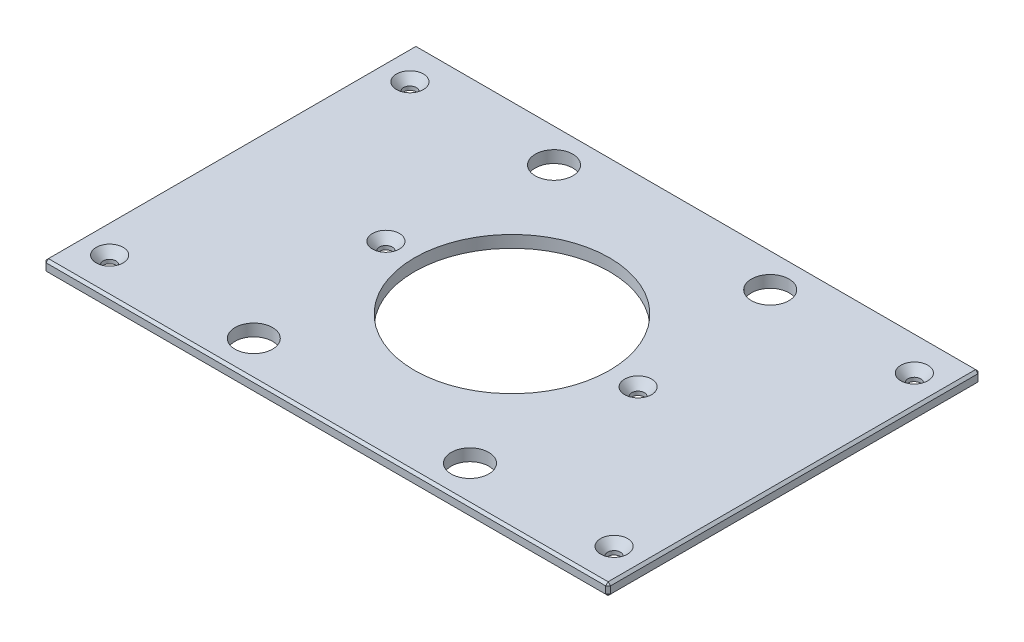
from build123d import *

# Parameters (mm, degrees)
SKETCH1_W                                     = 298.45
SKETCH1_H                                     = 196.85
BOSS_EXTRUDE1_DEPTH                           = 6.35
SKETCH13_R                                    = 51.562
CUT_EXTRUDE6_DEPTH                            = 179.873988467
F_25_32_0_78125_DIAMETER_HOLE1_D              = 19.84375
CHAMFER2_SIZE                                 = 1.27
CSK_FOR_1_4_FLAT_HEAD_MACHINE_SCREW1_AT_COUNT = 2
CSK_FOR_1_4_FLAT_HEAD_MACHINE_SCREW1_AT_PITCH = 158.75
CSK_FOR_1_4_FLAT_HEAD_MACHINE_SCREW1_2_COUNT  = 2
CSK_FOR_1_4_FLAT_HEAD_MACHINE_SCREW1_2_PITCH  = 310.37147501
CSK_FOR_1_4_FLAT_HEAD_MACHINE_SCREW1_3_COUNT  = 2
CSK_FOR_1_4_FLAT_HEAD_MACHINE_SCREW1_3_PITCH  = 215.198492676
CSK_FOR_1_4_FLAT_HEAD_MACHINE_SCREW1_4_COUNT  = 2
CSK_FOR_1_4_FLAT_HEAD_MACHINE_SCREW1_4_PITCH  = 103.662656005
CSK_FOR_1_4_FLAT_HEAD_MACHINE_SCREW1_5_COUNT  = 2
CSK_FOR_1_4_FLAT_HEAD_MACHINE_SCREW1_5_PITCH  = 266.7
CSK_FOR_1_4_FLAT_HEAD_MACHINE_SCREW1_6_COUNT  = 2
CSK_FOR_1_4_FLAT_HEAD_MACHINE_SCREW1_6_PITCH  = 190.5
CSK_FOR_1_4_FLAT_HEAD_MACHINE_SCREW1_7_COUNT  = 2
CSK_FOR_1_4_FLAT_HEAD_MACHINE_SCREW1_7_PITCH  = 247.97542721


with BuildPart() as part:
    # Sketch1 → Boss-Extrude1 (new body)
    with BuildSketch(Plane(origin=(0, 0, 0), x_dir=(1, 0, 0), z_dir=(0, 1, 0))):
        Rectangle(SKETCH1_W, SKETCH1_H)
    extrude(amount=BOSS_EXTRUDE1_DEPTH)

    # Sketch13 → Cut-Extrude6 (cut, through all)
    with BuildSketch(Plane(origin=(0, 6.35, 0), x_dir=(1, 0, 0), z_dir=(0, 1, 0))):
        with Locations(Location((0, 0, 0), (0, 0, 270))):
            Circle(SKETCH13_R)
    extrude(amount=-CUT_EXTRUDE6_DEPTH, mode=Mode.SUBTRACT)

    # 25_32 _0.78125_ Diameter Hole1 (through all)
    with Locations(Plane(origin=(0, 6.35, 0), x_dir=(1, 0, 0), z_dir=(0, 1, 0))):
        with Locations((57.15, 79.375), (-57.15, 79.375), (57.15, -79.375), (-57.15, -79.375)):
            Hole(F_25_32_0_78125_DIAMETER_HOLE1_D / 2)

    # Chamfer2
    chamfer2_edges = [part.edges().sort_by_distance(p)[0] for p in [
        (149.225, 6.35, 0),
        (0, 6.35, -98.425),
        (-149.225, 6.35, 0),
        (0, 0, -98.425),
        (149.225, 0, 0),
        (0, 0, 98.425),
        (-149.225, 0, 0),
        (0, 6.35, 98.425),
        (-149.225, 3.175, -98.425),
        (149.225, 3.175, -98.425),
        (149.225, 3.175, 98.425),
        (-149.225, 3.175, 98.425),
    ]]
    chamfer(chamfer2_edges, length=CHAMFER2_SIZE)

    # Sketch24 → CSK for 1_4 Flat Head Machine Screw1 (revolve, cut)
    with BuildSketch(Plane(origin=(133.35, 6.35, -79.375), x_dir=(0, 0, 1), z_dir=(1, 0, 0))):
        Polygon((0, 0), (0, 6.35), (3.3782, 6.35), (3.3782, 4.324464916), (7.1374, 0), align=None)
    csk_for_1_4_flat_head_machine_screw1 = revolve(axis=Axis((133.35, 12.7, -79.375), (0, -1, 0)), mode=Mode.SUBTRACT)

    # CSK for 1_4 Flat Head Machine Screw1 at: CSK for 1_4 Flat Head Machine Screw1 ×2
    with Locations(*[(0, 0, i * CSK_FOR_1_4_FLAT_HEAD_MACHINE_SCREW1_AT_PITCH) for i in range(1, CSK_FOR_1_4_FLAT_HEAD_MACHINE_SCREW1_AT_COUNT)]):
        add(csk_for_1_4_flat_head_machine_screw1, mode=Mode.SUBTRACT)

    # CSK for 1_4 Flat Head Machine Screw1 2: CSK for 1_4 Flat Head Machine Screw1 ×2
    with Locations(*[Vector(-0.8592928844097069, 0, 0.5114838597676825) * (i * CSK_FOR_1_4_FLAT_HEAD_MACHINE_SCREW1_2_PITCH) for i in range(1, CSK_FOR_1_4_FLAT_HEAD_MACHINE_SCREW1_2_COUNT)]):
        add(csk_for_1_4_flat_head_machine_screw1, mode=Mode.SUBTRACT)

    # CSK for 1_4 Flat Head Machine Screw1 3: CSK for 1_4 Flat Head Machine Screw1 ×2
    with Locations(*[Vector(-0.9294907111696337, 0, 0.3688455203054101) * (i * CSK_FOR_1_4_FLAT_HEAD_MACHINE_SCREW1_3_PITCH) for i in range(1, CSK_FOR_1_4_FLAT_HEAD_MACHINE_SCREW1_3_COUNT)]):
        add(csk_for_1_4_flat_head_machine_screw1, mode=Mode.SUBTRACT)

    # CSK for 1_4 Flat Head Machine Screw1 4: CSK for 1_4 Flat Head Machine Screw1 ×2
    with Locations(*[Vector(-0.6431920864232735, 0, 0.765704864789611) * (i * CSK_FOR_1_4_FLAT_HEAD_MACHINE_SCREW1_4_PITCH) for i in range(1, CSK_FOR_1_4_FLAT_HEAD_MACHINE_SCREW1_4_COUNT)]):
        add(csk_for_1_4_flat_head_machine_screw1, mode=Mode.SUBTRACT)

    # CSK for 1_4 Flat Head Machine Screw1 5: CSK for 1_4 Flat Head Machine Screw1 ×2
    with Locations(*[(-i * CSK_FOR_1_4_FLAT_HEAD_MACHINE_SCREW1_5_PITCH, 0, 0) for i in range(1, CSK_FOR_1_4_FLAT_HEAD_MACHINE_SCREW1_5_COUNT)]):
        add(csk_for_1_4_flat_head_machine_screw1, mode=Mode.SUBTRACT)

    # CSK for 1_4 Flat Head Machine Screw1 6: CSK for 1_4 Flat Head Machine Screw1 ×2
    with Locations(*[(-i * CSK_FOR_1_4_FLAT_HEAD_MACHINE_SCREW1_6_PITCH, 0, 0) for i in range(1, CSK_FOR_1_4_FLAT_HEAD_MACHINE_SCREW1_6_COUNT)]):
        add(csk_for_1_4_flat_head_machine_screw1, mode=Mode.SUBTRACT)

    # CSK for 1_4 Flat Head Machine Screw1 7: CSK for 1_4 Flat Head Machine Screw1 ×2
    with Locations(*[Vector(-0.768221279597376, 0, 0.6401843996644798) * (i * CSK_FOR_1_4_FLAT_HEAD_MACHINE_SCREW1_7_PITCH) for i in range(1, CSK_FOR_1_4_FLAT_HEAD_MACHINE_SCREW1_7_COUNT)]):
        add(csk_for_1_4_flat_head_machine_screw1, mode=Mode.SUBTRACT)


solid = part.part
